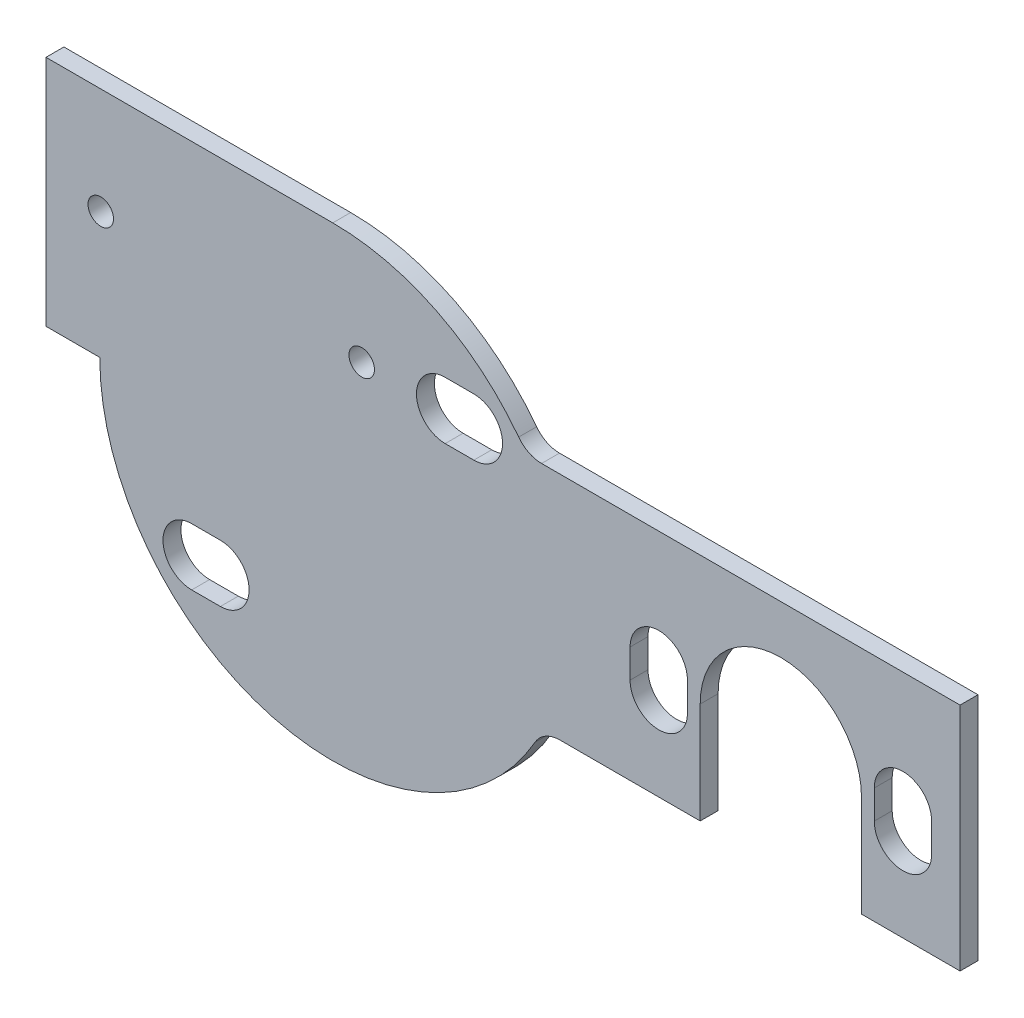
from build123d import *

# Parameters (mm, degrees)
EXTRUDE1_DEPTH        = 1.5875
CUT_EXTRUDE1_DEPTH    = 63.979401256
F_4_40_TAPPED_HOLE1_D = 2.2606


with BuildPart() as part:
    # Sketch1 → Extrude1 (new body)
    with BuildSketch(Plane.XY):
        with BuildLine():
            Line((20.116701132, 0), (32.54375, 0))
            Line((32.54375, 0), (32.54375, 8.971509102))
            ThreePointArc((32.54375, 8.971509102), (39.6875, 16.115259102), (46.83125, 8.971509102))
            Line((46.83125, 8.971509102), (46.83125, 0))
            Line((46.83125, 0), (55.5625, 0))
            Line((55.5625, 0), (55.5625, 20.401509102))
            Line((55.5625, 20.401509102), (18.494204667, 20.401509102))
            ThreePointArc((18.494204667, 20.401509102), (17.362178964, 20.667719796), (16.467442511, 21.410550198))
            ThreePointArc((16.467442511, 21.410550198), (9.197708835, 27.446047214), (0, 29.609009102))
            Line((0, 29.609009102), (-25.4, 29.609009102))
            Line((-25.4, 29.609009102), (-25.4, 8.971509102))
            Line((-25.4, 8.971509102), (-20.6375, 8.971509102))
            ThreePointArc((-20.6375, 8.971509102), (-5.303055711, -10.973014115), (17.912131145, -1.278464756))
            ThreePointArc((17.912131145, -1.278464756), (18.842475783, -0.342740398), (20.116701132, 0))
        make_face()
    extrude(amount=EXTRUDE1_DEPTH)

    # Sketch2 → Cut-Extrude1 (cut, through all)
    with BuildSketch(Plane.XY.offset(1.5875)):
        with BuildLine():
            Line((26.33345, 10.241509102), (26.33345, 7.701509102))
            ThreePointArc((26.33345, 7.701509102), (28.87345, 5.161509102), (31.41345, 7.701509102))
            Line((31.41345, 7.701509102), (31.41345, 10.241509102))
            ThreePointArc((31.41345, 10.241509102), (28.87345, 12.781509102), (26.33345, 10.241509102))
        make_face()
        with BuildLine():
            Line((47.96155, 7.701509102), (47.96155, 10.241509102))
            ThreePointArc((47.96155, 10.241509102), (50.50155, 12.781509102), (53.04155, 10.241509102))
            Line((53.04155, 10.241509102), (53.04155, 7.701509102))
            ThreePointArc((53.04155, 7.701509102), (50.50155, 5.161509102), (47.96155, 7.701509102))
        make_face()
        with BuildLine():
            Line((12.495320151, 17.656829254), (9.955320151, 17.656829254))
            ThreePointArc((9.955320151, 17.656829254), (7.415320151, 20.196829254), (9.955320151, 22.736829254))
            Line((9.955320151, 22.736829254), (12.495320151, 22.736829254))
            ThreePointArc((12.495320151, 22.736829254), (15.035320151, 20.196829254), (12.495320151, 17.656829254))
        make_face()
        with BuildLine():
            Line((-9.955320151, -4.793811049), (-12.495320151, -4.793811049))
            ThreePointArc((-12.495320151, -4.793811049), (-15.035320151, -2.253811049), (-12.495320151, 0.286188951))
            Line((-12.495320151, 0.286188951), (-9.955320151, 0.286188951))
            ThreePointArc((-9.955320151, 0.286188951), (-7.415320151, -2.253811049), (-9.955320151, -4.793811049))
        make_face()
    extrude(amount=-CUT_EXTRUDE1_DEPTH, mode=Mode.SUBTRACT)

    # 4-40 Tapped Hole1 (through all)
    with Locations(Plane(origin=(-20.549339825, 20.197833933, 1.5875), x_dir=(1, 0, 0), z_dir=(0, 0, 1))):
        with Locations((0, 0), (23.114, 0)):
            Hole(F_4_40_TAPPED_HOLE1_D / 2)


solid = part.part
